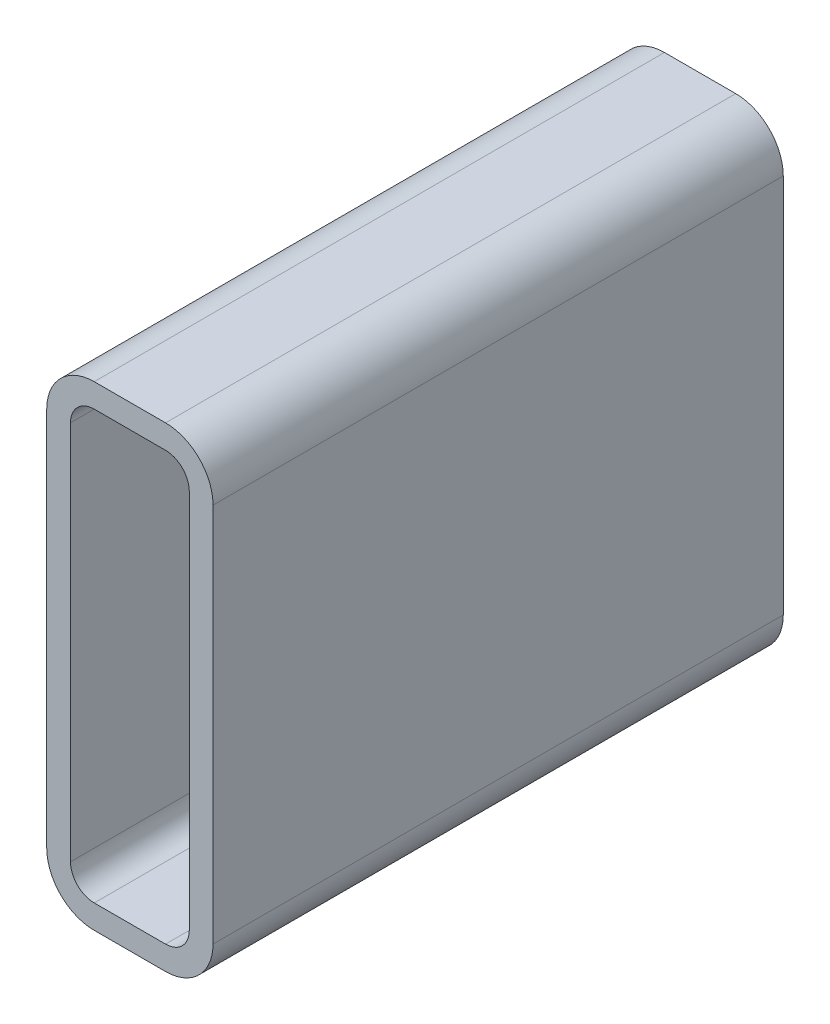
ISO-10303-21;
HEADER;
FILE_DESCRIPTION(('STEP AP214'),'2;1');
FILE_NAME('part.step','',(''),(''),'','','');
FILE_SCHEMA(('AUTOMOTIVE_DESIGN { 1 0 10303 214 1 1 1 1 }'));
ENDSEC;
DATA;
#1=APPLICATION_CONTEXT('core data for automotive mechanical design processes');
#2=APPLICATION_PROTOCOL_DEFINITION('international standard','automotive_design',2000,#1);
#3=PRODUCT_CONTEXT('',#1,'mechanical');
#4=PRODUCT('Part','Part','',(#3));
#5=PRODUCT_RELATED_PRODUCT_CATEGORY('part','',(#4));
#6=PRODUCT_DEFINITION_FORMATION('','',#4);
#7=PRODUCT_DEFINITION_CONTEXT('part definition',#1,'design');
#8=PRODUCT_DEFINITION('design','',#6,#7);
#9=PRODUCT_DEFINITION_SHAPE('','',#8);
#10=(LENGTH_UNIT() NAMED_UNIT(*) SI_UNIT(.MILLI.,.METRE.));
#11=(NAMED_UNIT(*) PLANE_ANGLE_UNIT() SI_UNIT($,.RADIAN.));
#12=(NAMED_UNIT(*) SI_UNIT($,.STERADIAN.) SOLID_ANGLE_UNIT());
#13=UNCERTAINTY_MEASURE_WITH_UNIT(LENGTH_MEASURE(1.E-05),#10,'distance_accuracy_value','');
#14=(GEOMETRIC_REPRESENTATION_CONTEXT(3) GLOBAL_UNCERTAINTY_ASSIGNED_CONTEXT((#13)) GLOBAL_UNIT_ASSIGNED_CONTEXT((#10,
#11,#12)) REPRESENTATION_CONTEXT('',''));
#15=CARTESIAN_POINT('',(0.,0.,0.));
#16=DIRECTION('',(0.,0.,1.));
#17=DIRECTION('',(1.,0.,0.));
#18=AXIS2_PLACEMENT_3D('',#15,#16,#17);
#19=CARTESIAN_POINT('',(27.4821469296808,230.520313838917,304.8));
#20=DIRECTION('',(0.,0.,1.));
#21=DIRECTION('',(1.,0.,0.));
#22=AXIS2_PLACEMENT_3D('',#19,#20,#21);
#23=PLANE('',#22);
#24=CARTESIAN_POINT('',(27.4821469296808,230.520313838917,304.8));
#25=DIRECTION('',(0.,0.,1.));
#26=DIRECTION('',(1.,0.,0.));
#27=AXIS2_PLACEMENT_3D('',#24,#25,#26);
#28=CIRCLE('',#27,25.4);
#29=CARTESIAN_POINT('',(27.4821469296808,255.920313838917,304.8));
#30=VERTEX_POINT('',#29);
#31=CARTESIAN_POINT('',(2.08214692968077,230.520313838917,304.8));
#32=VERTEX_POINT('',#31);
#33=EDGE_CURVE('E211',#30,#32,#28,.T.);
#34=ORIENTED_EDGE('',*,*,#33,.T.);
#35=DIRECTION('',(0.,-1.,0.));
#36=VECTOR('',#35,1.);
#37=CARTESIAN_POINT('',(2.08214692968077,27.3203138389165,304.8));
#38=LINE('',#37,#36);
#39=CARTESIAN_POINT('',(2.08214692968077,27.3203138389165,304.8));
#40=VERTEX_POINT('',#39);
#41=EDGE_CURVE('E214',#32,#40,#38,.T.);
#42=ORIENTED_EDGE('',*,*,#41,.T.);
#43=CARTESIAN_POINT('',(27.4821469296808,27.3203138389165,304.8));
#44=DIRECTION('',(0.,0.,1.));
#45=DIRECTION('',(1.,0.,0.));
#46=AXIS2_PLACEMENT_3D('',#43,#44,#45);
#47=CIRCLE('',#46,25.4);
#48=CARTESIAN_POINT('',(27.4821469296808,1.92031383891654,304.8));
#49=VERTEX_POINT('',#48);
#50=EDGE_CURVE('E217',#40,#49,#47,.T.);
#51=ORIENTED_EDGE('',*,*,#50,.T.);
#52=DIRECTION('',(1.,0.,0.));
#53=VECTOR('',#52,1.);
#54=CARTESIAN_POINT('',(65.5821469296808,1.92031383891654,304.8));
#55=LINE('',#54,#53);
#56=CARTESIAN_POINT('',(65.5821469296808,1.92031383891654,304.8));
#57=VERTEX_POINT('',#56);
#58=EDGE_CURVE('E219',#49,#57,#55,.T.);
#59=ORIENTED_EDGE('',*,*,#58,.T.);
#60=CARTESIAN_POINT('',(65.5821469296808,27.3203138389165,304.8));
#61=DIRECTION('',(0.,0.,1.));
#62=DIRECTION('',(1.,0.,0.));
#63=AXIS2_PLACEMENT_3D('',#60,#61,#62);
#64=CIRCLE('',#63,25.4);
#65=CARTESIAN_POINT('',(90.9821469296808,27.3203138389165,304.8));
#66=VERTEX_POINT('',#65);
#67=EDGE_CURVE('E221',#57,#66,#64,.T.);
#68=ORIENTED_EDGE('',*,*,#67,.T.);
#69=DIRECTION('',(0.,1.,0.));
#70=VECTOR('',#69,1.);
#71=CARTESIAN_POINT('',(90.9821469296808,230.520313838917,304.8));
#72=LINE('',#71,#70);
#73=CARTESIAN_POINT('',(90.9821469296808,230.520313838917,304.8));
#74=VERTEX_POINT('',#73);
#75=EDGE_CURVE('E223',#66,#74,#72,.T.);
#76=ORIENTED_EDGE('',*,*,#75,.T.);
#77=CARTESIAN_POINT('',(65.5821469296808,230.520313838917,304.8));
#78=DIRECTION('',(0.,0.,1.));
#79=DIRECTION('',(1.,0.,0.));
#80=AXIS2_PLACEMENT_3D('',#77,#78,#79);
#81=CIRCLE('',#80,25.4);
#82=CARTESIAN_POINT('',(65.5821469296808,255.920313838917,304.8));
#83=VERTEX_POINT('',#82);
#84=EDGE_CURVE('E225',#74,#83,#81,.T.);
#85=ORIENTED_EDGE('',*,*,#84,.T.);
#86=DIRECTION('',(-1.,0.,0.));
#87=VECTOR('',#86,1.);
#88=CARTESIAN_POINT('',(27.4821469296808,255.920313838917,304.8));
#89=LINE('',#88,#87);
#90=EDGE_CURVE('E227',#83,#30,#89,.T.);
#91=ORIENTED_EDGE('',*,*,#90,.T.);
#92=EDGE_LOOP('',(#34,#42,#51,#59,#68,#76,#85,#91));
#93=FACE_BOUND('',#92,.T.);
#94=DIRECTION('',(0.,-1.,0.));
#95=VECTOR('',#94,1.);
#96=CARTESIAN_POINT('',(14.7821469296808,27.3203138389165,304.8));
#97=LINE('',#96,#95);
#98=CARTESIAN_POINT('',(14.7821469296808,230.520313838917,304.8));
#99=VERTEX_POINT('',#98);
#100=CARTESIAN_POINT('',(14.7821469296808,27.3203138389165,304.8));
#101=VERTEX_POINT('',#100);
#102=EDGE_CURVE('E154',#99,#101,#97,.T.);
#103=ORIENTED_EDGE('',*,*,#102,.F.);
#104=CARTESIAN_POINT('',(27.4821469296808,230.520313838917,304.8));
#105=DIRECTION('',(0.,0.,1.));
#106=DIRECTION('',(1.,0.,0.));
#107=AXIS2_PLACEMENT_3D('',#104,#105,#106);
#108=CIRCLE('',#107,12.7);
#109=CARTESIAN_POINT('',(27.4821469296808,243.220313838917,304.8));
#110=VERTEX_POINT('',#109);
#111=EDGE_CURVE('E146',#110,#99,#108,.T.);
#112=ORIENTED_EDGE('',*,*,#111,.F.);
#113=DIRECTION('',(-1.,0.,0.));
#114=VECTOR('',#113,1.);
#115=CARTESIAN_POINT('',(27.4821469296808,243.220313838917,304.8));
#116=LINE('',#115,#114);
#117=CARTESIAN_POINT('',(65.5821469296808,243.220313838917,304.8));
#118=VERTEX_POINT('',#117);
#119=EDGE_CURVE('E179',#118,#110,#116,.T.);
#120=ORIENTED_EDGE('',*,*,#119,.F.);
#121=CARTESIAN_POINT('',(65.5821469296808,230.520313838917,304.8));
#122=DIRECTION('',(0.,0.,1.));
#123=DIRECTION('',(1.,0.,0.));
#124=AXIS2_PLACEMENT_3D('',#121,#122,#123);
#125=CIRCLE('',#124,12.7);
#126=CARTESIAN_POINT('',(78.2821469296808,230.520313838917,304.8));
#127=VERTEX_POINT('',#126);
#128=EDGE_CURVE('E177',#127,#118,#125,.T.);
#129=ORIENTED_EDGE('',*,*,#128,.F.);
#130=DIRECTION('',(0.,1.,0.));
#131=VECTOR('',#130,1.);
#132=CARTESIAN_POINT('',(78.2821469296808,230.520313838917,304.8));
#133=LINE('',#132,#131);
#134=CARTESIAN_POINT('',(78.2821469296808,27.3203138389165,304.8));
#135=VERTEX_POINT('',#134);
#136=EDGE_CURVE('E175',#135,#127,#133,.T.);
#137=ORIENTED_EDGE('',*,*,#136,.F.);
#138=CARTESIAN_POINT('',(65.5821469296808,27.3203138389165,304.8));
#139=DIRECTION('',(0.,0.,1.));
#140=DIRECTION('',(1.,0.,0.));
#141=AXIS2_PLACEMENT_3D('',#138,#139,#140);
#142=CIRCLE('',#141,12.7);
#143=CARTESIAN_POINT('',(65.5821469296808,14.6203138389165,304.8));
#144=VERTEX_POINT('',#143);
#145=EDGE_CURVE('E173',#144,#135,#142,.T.);
#146=ORIENTED_EDGE('',*,*,#145,.F.);
#147=DIRECTION('',(1.,0.,0.));
#148=VECTOR('',#147,1.);
#149=CARTESIAN_POINT('',(65.5821469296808,14.6203138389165,304.8));
#150=LINE('',#149,#148);
#151=CARTESIAN_POINT('',(27.4821469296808,14.6203138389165,304.8));
#152=VERTEX_POINT('',#151);
#153=EDGE_CURVE('E169',#152,#144,#150,.T.);
#154=ORIENTED_EDGE('',*,*,#153,.F.);
#155=CARTESIAN_POINT('',(27.4821469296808,27.3203138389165,304.8));
#156=DIRECTION('',(0.,0.,1.));
#157=DIRECTION('',(1.,0.,0.));
#158=AXIS2_PLACEMENT_3D('',#155,#156,#157);
#159=CIRCLE('',#158,12.7);
#160=EDGE_CURVE('E167',#101,#152,#159,.T.);
#161=ORIENTED_EDGE('',*,*,#160,.F.);
#162=EDGE_LOOP('',(#103,#112,#120,#129,#137,#146,#154,#161));
#163=FACE_BOUND('',#162,.T.);
#164=ADVANCED_FACE('F33',(#93,#163),#23,.T.);
#165=CARTESIAN_POINT('',(27.4821469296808,230.520313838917,0.));
#166=DIRECTION('',(0.,0.,1.));
#167=DIRECTION('',(1.,0.,0.));
#168=AXIS2_PLACEMENT_3D('',#165,#166,#167);
#169=PLANE('',#168);
#170=CARTESIAN_POINT('',(27.4821469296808,230.520313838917,0.));
#171=DIRECTION('',(0.,0.,1.));
#172=DIRECTION('',(1.,0.,0.));
#173=AXIS2_PLACEMENT_3D('',#170,#171,#172);
#174=CIRCLE('',#173,25.4);
#175=CARTESIAN_POINT('',(27.4821469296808,255.920313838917,0.));
#176=VERTEX_POINT('',#175);
#177=CARTESIAN_POINT('',(2.08214692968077,230.520313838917,0.));
#178=VERTEX_POINT('',#177);
#179=EDGE_CURVE('E162',#176,#178,#174,.T.);
#180=ORIENTED_EDGE('',*,*,#179,.F.);
#181=DIRECTION('',(-1.,0.,0.));
#182=VECTOR('',#181,1.);
#183=CARTESIAN_POINT('',(27.4821469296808,255.920313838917,0.));
#184=LINE('',#183,#182);
#185=CARTESIAN_POINT('',(65.5821469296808,255.920313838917,0.));
#186=VERTEX_POINT('',#185);
#187=EDGE_CURVE('E215',#186,#176,#184,.T.);
#188=ORIENTED_EDGE('',*,*,#187,.F.);
#189=CARTESIAN_POINT('',(65.5821469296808,230.520313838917,0.));
#190=DIRECTION('',(0.,0.,1.));
#191=DIRECTION('',(1.,0.,0.));
#192=AXIS2_PLACEMENT_3D('',#189,#190,#191);
#193=CIRCLE('',#192,25.4);
#194=CARTESIAN_POINT('',(90.9821469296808,230.520313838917,0.));
#195=VERTEX_POINT('',#194);
#196=EDGE_CURVE('E242',#195,#186,#193,.T.);
#197=ORIENTED_EDGE('',*,*,#196,.F.);
#198=DIRECTION('',(0.,1.,0.));
#199=VECTOR('',#198,1.);
#200=CARTESIAN_POINT('',(90.9821469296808,230.520313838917,0.));
#201=LINE('',#200,#199);
#202=CARTESIAN_POINT('',(90.9821469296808,27.3203138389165,0.));
#203=VERTEX_POINT('',#202);
#204=EDGE_CURVE('E240',#203,#195,#201,.T.);
#205=ORIENTED_EDGE('',*,*,#204,.F.);
#206=CARTESIAN_POINT('',(65.5821469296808,27.3203138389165,0.));
#207=DIRECTION('',(0.,0.,1.));
#208=DIRECTION('',(1.,0.,0.));
#209=AXIS2_PLACEMENT_3D('',#206,#207,#208);
#210=CIRCLE('',#209,25.4);
#211=CARTESIAN_POINT('',(65.5821469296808,1.92031383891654,0.));
#212=VERTEX_POINT('',#211);
#213=EDGE_CURVE('E238',#212,#203,#210,.T.);
#214=ORIENTED_EDGE('',*,*,#213,.F.);
#215=DIRECTION('',(1.,0.,0.));
#216=VECTOR('',#215,1.);
#217=CARTESIAN_POINT('',(65.5821469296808,1.92031383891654,0.));
#218=LINE('',#217,#216);
#219=CARTESIAN_POINT('',(27.4821469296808,1.92031383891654,0.));
#220=VERTEX_POINT('',#219);
#221=EDGE_CURVE('E236',#220,#212,#218,.T.);
#222=ORIENTED_EDGE('',*,*,#221,.F.);
#223=CARTESIAN_POINT('',(27.4821469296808,27.3203138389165,0.));
#224=DIRECTION('',(0.,0.,1.));
#225=DIRECTION('',(1.,0.,0.));
#226=AXIS2_PLACEMENT_3D('',#223,#224,#225);
#227=CIRCLE('',#226,25.4);
#228=CARTESIAN_POINT('',(2.08214692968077,27.3203138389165,0.));
#229=VERTEX_POINT('',#228);
#230=EDGE_CURVE('E234',#229,#220,#227,.T.);
#231=ORIENTED_EDGE('',*,*,#230,.F.);
#232=DIRECTION('',(0.,-1.,0.));
#233=VECTOR('',#232,1.);
#234=CARTESIAN_POINT('',(2.08214692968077,27.3203138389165,0.));
#235=LINE('',#234,#233);
#236=EDGE_CURVE('E232',#178,#229,#235,.T.);
#237=ORIENTED_EDGE('',*,*,#236,.F.);
#238=EDGE_LOOP('',(#180,#188,#197,#205,#214,#222,#231,#237));
#239=FACE_BOUND('',#238,.T.);
#240=CARTESIAN_POINT('',(27.4821469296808,230.520313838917,0.));
#241=DIRECTION('',(0.,0.,1.));
#242=DIRECTION('',(1.,0.,0.));
#243=AXIS2_PLACEMENT_3D('',#240,#241,#242);
#244=CIRCLE('',#243,12.7);
#245=CARTESIAN_POINT('',(27.4821469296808,243.220313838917,0.));
#246=VERTEX_POINT('',#245);
#247=CARTESIAN_POINT('',(14.7821469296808,230.520313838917,0.));
#248=VERTEX_POINT('',#247);
#249=EDGE_CURVE('E56',#246,#248,#244,.T.);
#250=ORIENTED_EDGE('',*,*,#249,.T.);
#251=DIRECTION('',(0.,-1.,0.));
#252=VECTOR('',#251,1.);
#253=CARTESIAN_POINT('',(14.7821469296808,27.3203138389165,0.));
#254=LINE('',#253,#252);
#255=CARTESIAN_POINT('',(14.7821469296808,27.3203138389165,0.));
#256=VERTEX_POINT('',#255);
#257=EDGE_CURVE('E161',#248,#256,#254,.T.);
#258=ORIENTED_EDGE('',*,*,#257,.T.);
#259=CARTESIAN_POINT('',(27.4821469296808,27.3203138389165,0.));
#260=DIRECTION('',(0.,0.,1.));
#261=DIRECTION('',(1.,0.,0.));
#262=AXIS2_PLACEMENT_3D('',#259,#260,#261);
#263=CIRCLE('',#262,12.7);
#264=CARTESIAN_POINT('',(27.4821469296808,14.6203138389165,0.));
#265=VERTEX_POINT('',#264);
#266=EDGE_CURVE('E183',#256,#265,#263,.T.);
#267=ORIENTED_EDGE('',*,*,#266,.T.);
#268=DIRECTION('',(1.,0.,0.));
#269=VECTOR('',#268,1.);
#270=CARTESIAN_POINT('',(65.5821469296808,14.6203138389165,0.));
#271=LINE('',#270,#269);
#272=CARTESIAN_POINT('',(65.5821469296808,14.6203138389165,0.));
#273=VERTEX_POINT('',#272);
#274=EDGE_CURVE('E186',#265,#273,#271,.T.);
#275=ORIENTED_EDGE('',*,*,#274,.T.);
#276=CARTESIAN_POINT('',(65.5821469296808,27.3203138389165,0.));
#277=DIRECTION('',(0.,0.,1.));
#278=DIRECTION('',(1.,0.,0.));
#279=AXIS2_PLACEMENT_3D('',#276,#277,#278);
#280=CIRCLE('',#279,12.7);
#281=CARTESIAN_POINT('',(78.2821469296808,27.3203138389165,0.));
#282=VERTEX_POINT('',#281);
#283=EDGE_CURVE('E189',#273,#282,#280,.T.);
#284=ORIENTED_EDGE('',*,*,#283,.T.);
#285=DIRECTION('',(0.,1.,0.));
#286=VECTOR('',#285,1.);
#287=CARTESIAN_POINT('',(78.2821469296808,230.520313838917,0.));
#288=LINE('',#287,#286);
#289=CARTESIAN_POINT('',(78.2821469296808,230.520313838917,0.));
#290=VERTEX_POINT('',#289);
#291=EDGE_CURVE('E192',#282,#290,#288,.T.);
#292=ORIENTED_EDGE('',*,*,#291,.T.);
#293=CARTESIAN_POINT('',(65.5821469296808,230.520313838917,0.));
#294=DIRECTION('',(0.,0.,1.));
#295=DIRECTION('',(1.,0.,0.));
#296=AXIS2_PLACEMENT_3D('',#293,#294,#295);
#297=CIRCLE('',#296,12.7);
#298=CARTESIAN_POINT('',(65.5821469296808,243.220313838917,0.));
#299=VERTEX_POINT('',#298);
#300=EDGE_CURVE('E195',#290,#299,#297,.T.);
#301=ORIENTED_EDGE('',*,*,#300,.T.);
#302=DIRECTION('',(-1.,0.,0.));
#303=VECTOR('',#302,1.);
#304=CARTESIAN_POINT('',(27.4821469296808,243.220313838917,0.));
#305=LINE('',#304,#303);
#306=EDGE_CURVE('E155',#299,#246,#305,.T.);
#307=ORIENTED_EDGE('',*,*,#306,.T.);
#308=EDGE_LOOP('',(#250,#258,#267,#275,#284,#292,#301,#307));
#309=FACE_BOUND('',#308,.T.);
#310=ADVANCED_FACE('F272',(#239,#309),#169,.F.);
#311=CARTESIAN_POINT('',(27.4821469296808,230.520313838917,304.8));
#312=DIRECTION('',(0.,0.,-1.));
#313=DIRECTION('',(-1.,0.,0.));
#314=AXIS2_PLACEMENT_3D('',#311,#312,#313);
#315=CYLINDRICAL_SURFACE('',#314,25.4);
#316=ORIENTED_EDGE('',*,*,#179,.T.);
#317=DIRECTION('',(0.,0.,-1.));
#318=VECTOR('',#317,1.);
#319=CARTESIAN_POINT('',(2.08214692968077,230.520313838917,304.8));
#320=LINE('',#319,#318);
#321=EDGE_CURVE('E11',#32,#178,#320,.T.);
#322=ORIENTED_EDGE('',*,*,#321,.F.);
#323=ORIENTED_EDGE('',*,*,#33,.F.);
#324=DIRECTION('',(0.,0.,-1.));
#325=VECTOR('',#324,1.);
#326=CARTESIAN_POINT('',(27.4821469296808,255.920313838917,304.8));
#327=LINE('',#326,#325);
#328=EDGE_CURVE('E229',#30,#176,#327,.T.);
#329=ORIENTED_EDGE('',*,*,#328,.T.);
#330=EDGE_LOOP('',(#316,#322,#323,#329));
#331=FACE_BOUND('',#330,.T.);
#332=ADVANCED_FACE('F35',(#331),#315,.T.);
#333=CARTESIAN_POINT('',(2.08214692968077,27.3203138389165,304.8));
#334=DIRECTION('',(1.,0.,0.));
#335=DIRECTION('',(0.,0.,-1.));
#336=AXIS2_PLACEMENT_3D('',#333,#334,#335);
#337=PLANE('',#336);
#338=ORIENTED_EDGE('',*,*,#236,.T.);
#339=DIRECTION('',(0.,0.,-1.));
#340=VECTOR('',#339,1.);
#341=CARTESIAN_POINT('',(2.08214692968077,27.3203138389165,304.8));
#342=LINE('',#341,#340);
#343=EDGE_CURVE('E41',#40,#229,#342,.T.);
#344=ORIENTED_EDGE('',*,*,#343,.F.);
#345=ORIENTED_EDGE('',*,*,#41,.F.);
#346=ORIENTED_EDGE('',*,*,#321,.T.);
#347=EDGE_LOOP('',(#338,#344,#345,#346));
#348=FACE_BOUND('',#347,.T.);
#349=ADVANCED_FACE('F289',(#348),#337,.F.);
#350=CARTESIAN_POINT('',(27.4821469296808,27.3203138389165,304.8));
#351=DIRECTION('',(0.,0.,-1.));
#352=DIRECTION('',(-1.,0.,0.));
#353=AXIS2_PLACEMENT_3D('',#350,#351,#352);
#354=CYLINDRICAL_SURFACE('',#353,25.4);
#355=ORIENTED_EDGE('',*,*,#230,.T.);
#356=DIRECTION('',(0.,0.,-1.));
#357=VECTOR('',#356,1.);
#358=CARTESIAN_POINT('',(27.4821469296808,1.92031383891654,304.8));
#359=LINE('',#358,#357);
#360=EDGE_CURVE('E259',#49,#220,#359,.T.);
#361=ORIENTED_EDGE('',*,*,#360,.F.);
#362=ORIENTED_EDGE('',*,*,#50,.F.);
#363=ORIENTED_EDGE('',*,*,#343,.T.);
#364=EDGE_LOOP('',(#355,#361,#362,#363));
#365=FACE_BOUND('',#364,.T.);
#366=ADVANCED_FACE('F266',(#365),#354,.T.);
#367=CARTESIAN_POINT('',(65.5821469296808,1.92031383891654,304.8));
#368=DIRECTION('',(0.,1.,0.));
#369=DIRECTION('',(0.,0.,1.));
#370=AXIS2_PLACEMENT_3D('',#367,#368,#369);
#371=PLANE('',#370);
#372=ORIENTED_EDGE('',*,*,#221,.T.);
#373=DIRECTION('',(0.,0.,-1.));
#374=VECTOR('',#373,1.);
#375=CARTESIAN_POINT('',(65.5821469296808,1.92031383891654,304.8));
#376=LINE('',#375,#374);
#377=EDGE_CURVE('E256',#57,#212,#376,.T.);
#378=ORIENTED_EDGE('',*,*,#377,.F.);
#379=ORIENTED_EDGE('',*,*,#58,.F.);
#380=ORIENTED_EDGE('',*,*,#360,.T.);
#381=EDGE_LOOP('',(#372,#378,#379,#380));
#382=FACE_BOUND('',#381,.T.);
#383=ADVANCED_FACE('F278',(#382),#371,.F.);
#384=CARTESIAN_POINT('',(65.5821469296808,27.3203138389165,304.8));
#385=DIRECTION('',(0.,0.,-1.));
#386=DIRECTION('',(-1.,0.,0.));
#387=AXIS2_PLACEMENT_3D('',#384,#385,#386);
#388=CYLINDRICAL_SURFACE('',#387,25.4);
#389=ORIENTED_EDGE('',*,*,#213,.T.);
#390=DIRECTION('',(0.,0.,-1.));
#391=VECTOR('',#390,1.);
#392=CARTESIAN_POINT('',(90.9821469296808,27.3203138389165,304.8));
#393=LINE('',#392,#391);
#394=EDGE_CURVE('E253',#66,#203,#393,.T.);
#395=ORIENTED_EDGE('',*,*,#394,.F.);
#396=ORIENTED_EDGE('',*,*,#67,.F.);
#397=ORIENTED_EDGE('',*,*,#377,.T.);
#398=EDGE_LOOP('',(#389,#395,#396,#397));
#399=FACE_BOUND('',#398,.T.);
#400=ADVANCED_FACE('F282',(#399),#388,.T.);
#401=CARTESIAN_POINT('',(90.9821469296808,230.520313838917,304.8));
#402=DIRECTION('',(-1.,0.,0.));
#403=DIRECTION('',(0.,0.,1.));
#404=AXIS2_PLACEMENT_3D('',#401,#402,#403);
#405=PLANE('',#404);
#406=ORIENTED_EDGE('',*,*,#204,.T.);
#407=DIRECTION('',(0.,0.,-1.));
#408=VECTOR('',#407,1.);
#409=CARTESIAN_POINT('',(90.9821469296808,230.520313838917,304.8));
#410=LINE('',#409,#408);
#411=EDGE_CURVE('E250',#74,#195,#410,.T.);
#412=ORIENTED_EDGE('',*,*,#411,.F.);
#413=ORIENTED_EDGE('',*,*,#75,.F.);
#414=ORIENTED_EDGE('',*,*,#394,.T.);
#415=EDGE_LOOP('',(#406,#412,#413,#414));
#416=FACE_BOUND('',#415,.T.);
#417=ADVANCED_FACE('F302',(#416),#405,.F.);
#418=CARTESIAN_POINT('',(65.5821469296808,230.520313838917,304.8));
#419=DIRECTION('',(0.,0.,-1.));
#420=DIRECTION('',(-1.,0.,0.));
#421=AXIS2_PLACEMENT_3D('',#418,#419,#420);
#422=CYLINDRICAL_SURFACE('',#421,25.4);
#423=ORIENTED_EDGE('',*,*,#196,.T.);
#424=DIRECTION('',(0.,0.,-1.));
#425=VECTOR('',#424,1.);
#426=CARTESIAN_POINT('',(65.5821469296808,255.920313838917,304.8));
#427=LINE('',#426,#425);
#428=EDGE_CURVE('E247',#83,#186,#427,.T.);
#429=ORIENTED_EDGE('',*,*,#428,.F.);
#430=ORIENTED_EDGE('',*,*,#84,.F.);
#431=ORIENTED_EDGE('',*,*,#411,.T.);
#432=EDGE_LOOP('',(#423,#429,#430,#431));
#433=FACE_BOUND('',#432,.T.);
#434=ADVANCED_FACE('F300',(#433),#422,.T.);
#435=CARTESIAN_POINT('',(27.4821469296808,255.920313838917,304.8));
#436=DIRECTION('',(0.,-1.,0.));
#437=DIRECTION('',(0.,0.,-1.));
#438=AXIS2_PLACEMENT_3D('',#435,#436,#437);
#439=PLANE('',#438);
#440=ORIENTED_EDGE('',*,*,#187,.T.);
#441=ORIENTED_EDGE('',*,*,#328,.F.);
#442=ORIENTED_EDGE('',*,*,#90,.F.);
#443=ORIENTED_EDGE('',*,*,#428,.T.);
#444=EDGE_LOOP('',(#440,#441,#442,#443));
#445=FACE_BOUND('',#444,.T.);
#446=ADVANCED_FACE('F295',(#445),#439,.F.);
#447=CARTESIAN_POINT('',(27.4821469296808,230.520313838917,304.8));
#448=DIRECTION('',(0.,0.,-1.));
#449=DIRECTION('',(-1.,0.,0.));
#450=AXIS2_PLACEMENT_3D('',#447,#448,#449);
#451=CYLINDRICAL_SURFACE('',#450,12.7);
#452=ORIENTED_EDGE('',*,*,#249,.F.);
#453=DIRECTION('',(0.,0.,-1.));
#454=VECTOR('',#453,1.);
#455=CARTESIAN_POINT('',(27.4821469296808,243.220313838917,304.8));
#456=LINE('',#455,#454);
#457=EDGE_CURVE('E150',#110,#246,#456,.T.);
#458=ORIENTED_EDGE('',*,*,#457,.F.);
#459=ORIENTED_EDGE('',*,*,#111,.T.);
#460=DIRECTION('',(0.,0.,-1.));
#461=VECTOR('',#460,1.);
#462=CARTESIAN_POINT('',(14.7821469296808,230.520313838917,304.8));
#463=LINE('',#462,#461);
#464=EDGE_CURVE('E149',#99,#248,#463,.T.);
#465=ORIENTED_EDGE('',*,*,#464,.T.);
#466=EDGE_LOOP('',(#452,#458,#459,#465));
#467=FACE_BOUND('',#466,.T.);
#468=ADVANCED_FACE('F148',(#467),#451,.F.);
#469=CARTESIAN_POINT('',(14.7821469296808,27.3203138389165,304.8));
#470=DIRECTION('',(1.,0.,0.));
#471=DIRECTION('',(0.,0.,-1.));
#472=AXIS2_PLACEMENT_3D('',#469,#470,#471);
#473=PLANE('',#472);
#474=ORIENTED_EDGE('',*,*,#257,.F.);
#475=ORIENTED_EDGE('',*,*,#464,.F.);
#476=ORIENTED_EDGE('',*,*,#102,.T.);
#477=DIRECTION('',(0.,0.,-1.));
#478=VECTOR('',#477,1.);
#479=CARTESIAN_POINT('',(14.7821469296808,27.3203138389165,304.8));
#480=LINE('',#479,#478);
#481=EDGE_CURVE('E163',#101,#256,#480,.T.);
#482=ORIENTED_EDGE('',*,*,#481,.T.);
#483=EDGE_LOOP('',(#474,#475,#476,#482));
#484=FACE_BOUND('',#483,.T.);
#485=ADVANCED_FACE('F158',(#484),#473,.T.);
#486=CARTESIAN_POINT('',(27.4821469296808,27.3203138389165,304.8));
#487=DIRECTION('',(0.,0.,-1.));
#488=DIRECTION('',(-1.,0.,0.));
#489=AXIS2_PLACEMENT_3D('',#486,#487,#488);
#490=CYLINDRICAL_SURFACE('',#489,12.7);
#491=ORIENTED_EDGE('',*,*,#266,.F.);
#492=ORIENTED_EDGE('',*,*,#481,.F.);
#493=ORIENTED_EDGE('',*,*,#160,.T.);
#494=DIRECTION('',(0.,0.,-1.));
#495=VECTOR('',#494,1.);
#496=CARTESIAN_POINT('',(27.4821469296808,14.6203138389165,304.8));
#497=LINE('',#496,#495);
#498=EDGE_CURVE('E208',#152,#265,#497,.T.);
#499=ORIENTED_EDGE('',*,*,#498,.T.);
#500=EDGE_LOOP('',(#491,#492,#493,#499));
#501=FACE_BOUND('',#500,.T.);
#502=ADVANCED_FACE('F327',(#501),#490,.F.);
#503=CARTESIAN_POINT('',(65.5821469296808,14.6203138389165,304.8));
#504=DIRECTION('',(0.,1.,0.));
#505=DIRECTION('',(0.,0.,1.));
#506=AXIS2_PLACEMENT_3D('',#503,#504,#505);
#507=PLANE('',#506);
#508=ORIENTED_EDGE('',*,*,#274,.F.);
#509=ORIENTED_EDGE('',*,*,#498,.F.);
#510=ORIENTED_EDGE('',*,*,#153,.T.);
#511=DIRECTION('',(0.,0.,-1.));
#512=VECTOR('',#511,1.);
#513=CARTESIAN_POINT('',(65.5821469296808,14.6203138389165,304.8));
#514=LINE('',#513,#512);
#515=EDGE_CURVE('E206',#144,#273,#514,.T.);
#516=ORIENTED_EDGE('',*,*,#515,.T.);
#517=EDGE_LOOP('',(#508,#509,#510,#516));
#518=FACE_BOUND('',#517,.T.);
#519=ADVANCED_FACE('F331',(#518),#507,.T.);
#520=CARTESIAN_POINT('',(65.5821469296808,27.3203138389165,304.8));
#521=DIRECTION('',(0.,0.,-1.));
#522=DIRECTION('',(-1.,0.,0.));
#523=AXIS2_PLACEMENT_3D('',#520,#521,#522);
#524=CYLINDRICAL_SURFACE('',#523,12.7);
#525=ORIENTED_EDGE('',*,*,#283,.F.);
#526=ORIENTED_EDGE('',*,*,#515,.F.);
#527=ORIENTED_EDGE('',*,*,#145,.T.);
#528=DIRECTION('',(0.,0.,-1.));
#529=VECTOR('',#528,1.);
#530=CARTESIAN_POINT('',(78.2821469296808,27.3203138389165,304.8));
#531=LINE('',#530,#529);
#532=EDGE_CURVE('E204',#135,#282,#531,.T.);
#533=ORIENTED_EDGE('',*,*,#532,.T.);
#534=EDGE_LOOP('',(#525,#526,#527,#533));
#535=FACE_BOUND('',#534,.T.);
#536=ADVANCED_FACE('F337',(#535),#524,.F.);
#537=CARTESIAN_POINT('',(78.2821469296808,230.520313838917,304.8));
#538=DIRECTION('',(-1.,0.,0.));
#539=DIRECTION('',(0.,0.,1.));
#540=AXIS2_PLACEMENT_3D('',#537,#538,#539);
#541=PLANE('',#540);
#542=ORIENTED_EDGE('',*,*,#291,.F.);
#543=ORIENTED_EDGE('',*,*,#532,.F.);
#544=ORIENTED_EDGE('',*,*,#136,.T.);
#545=DIRECTION('',(0.,0.,-1.));
#546=VECTOR('',#545,1.);
#547=CARTESIAN_POINT('',(78.2821469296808,230.520313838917,304.8));
#548=LINE('',#547,#546);
#549=EDGE_CURVE('E202',#127,#290,#548,.T.);
#550=ORIENTED_EDGE('',*,*,#549,.T.);
#551=EDGE_LOOP('',(#542,#543,#544,#550));
#552=FACE_BOUND('',#551,.T.);
#553=ADVANCED_FACE('F341',(#552),#541,.T.);
#554=CARTESIAN_POINT('',(65.5821469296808,230.520313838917,304.8));
#555=DIRECTION('',(0.,0.,-1.));
#556=DIRECTION('',(-1.,0.,0.));
#557=AXIS2_PLACEMENT_3D('',#554,#555,#556);
#558=CYLINDRICAL_SURFACE('',#557,12.7);
#559=ORIENTED_EDGE('',*,*,#300,.F.);
#560=ORIENTED_EDGE('',*,*,#549,.F.);
#561=ORIENTED_EDGE('',*,*,#128,.T.);
#562=DIRECTION('',(0.,0.,-1.));
#563=VECTOR('',#562,1.);
#564=CARTESIAN_POINT('',(65.5821469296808,243.220313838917,304.8));
#565=LINE('',#564,#563);
#566=EDGE_CURVE('E48',#118,#299,#565,.T.);
#567=ORIENTED_EDGE('',*,*,#566,.T.);
#568=EDGE_LOOP('',(#559,#560,#561,#567));
#569=FACE_BOUND('',#568,.T.);
#570=ADVANCED_FACE('F345',(#569),#558,.F.);
#571=CARTESIAN_POINT('',(27.4821469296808,243.220313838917,304.8));
#572=DIRECTION('',(0.,-1.,0.));
#573=DIRECTION('',(0.,0.,-1.));
#574=AXIS2_PLACEMENT_3D('',#571,#572,#573);
#575=PLANE('',#574);
#576=ORIENTED_EDGE('',*,*,#306,.F.);
#577=ORIENTED_EDGE('',*,*,#566,.F.);
#578=ORIENTED_EDGE('',*,*,#119,.T.);
#579=ORIENTED_EDGE('',*,*,#457,.T.);
#580=EDGE_LOOP('',(#576,#577,#578,#579));
#581=FACE_BOUND('',#580,.T.);
#582=ADVANCED_FACE('F349',(#581),#575,.T.);
#583=CLOSED_SHELL('',(#164,#310,#332,#349,#366,#383,#400,#417,#434,#446,#468,#485,#502,#519,
#536,#553,#570,#582));
#584=MANIFOLD_SOLID_BREP('B2',#583);
#585=ADVANCED_BREP_SHAPE_REPRESENTATION('',(#18,#584),#14);
#586=SHAPE_DEFINITION_REPRESENTATION(#9,#585);
ENDSEC;
END-ISO-10303-21;
